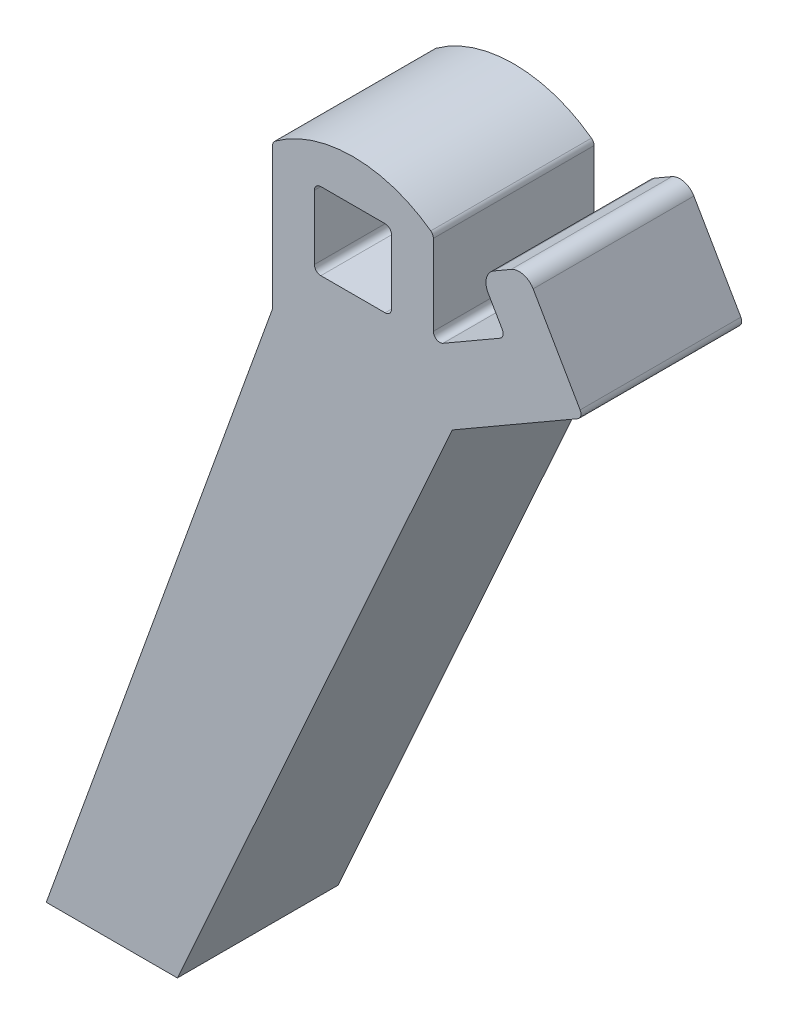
ISO-10303-21;
HEADER;
FILE_DESCRIPTION(('STEP AP214'),'2;1');
FILE_NAME('part.step','',(''),(''),'','','');
FILE_SCHEMA(('AUTOMOTIVE_DESIGN { 1 0 10303 214 1 1 1 1 }'));
ENDSEC;
DATA;
#1=APPLICATION_CONTEXT('core data for automotive mechanical design processes');
#2=APPLICATION_PROTOCOL_DEFINITION('international standard','automotive_design',2000,#1);
#3=PRODUCT_CONTEXT('',#1,'mechanical');
#4=PRODUCT('Part','Part','',(#3));
#5=PRODUCT_RELATED_PRODUCT_CATEGORY('part','',(#4));
#6=PRODUCT_DEFINITION_FORMATION('','',#4);
#7=PRODUCT_DEFINITION_CONTEXT('part definition',#1,'design');
#8=PRODUCT_DEFINITION('design','',#6,#7);
#9=PRODUCT_DEFINITION_SHAPE('','',#8);
#10=(LENGTH_UNIT() NAMED_UNIT(*) SI_UNIT(.MILLI.,.METRE.));
#11=(NAMED_UNIT(*) PLANE_ANGLE_UNIT() SI_UNIT($,.RADIAN.));
#12=(NAMED_UNIT(*) SI_UNIT($,.STERADIAN.) SOLID_ANGLE_UNIT());
#13=UNCERTAINTY_MEASURE_WITH_UNIT(LENGTH_MEASURE(1.E-05),#10,'distance_accuracy_value','');
#14=(GEOMETRIC_REPRESENTATION_CONTEXT(3) GLOBAL_UNCERTAINTY_ASSIGNED_CONTEXT((#13)) GLOBAL_UNIT_ASSIGNED_CONTEXT((#10,
#11,#12)) REPRESENTATION_CONTEXT('',''));
#15=CARTESIAN_POINT('',(0.,0.,0.));
#16=DIRECTION('',(0.,0.,1.));
#17=DIRECTION('',(1.,0.,0.));
#18=AXIS2_PLACEMENT_3D('',#15,#16,#17);
#19=CARTESIAN_POINT('',(12.1164041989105,26.3831358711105,6.35));
#20=DIRECTION('',(0.,0.,1.));
#21=DIRECTION('',(1.,0.,0.));
#22=AXIS2_PLACEMENT_3D('',#19,#20,#21);
#23=PLANE('',#22);
#24=DIRECTION('',(-0.5,0.866025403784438,0.));
#25=VECTOR('',#24,1.);
#26=CARTESIAN_POINT('',(21.2166310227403,27.1696600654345,6.35));
#27=LINE('',#26,#25);
#28=CARTESIAN_POINT('',(21.0896310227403,27.3896305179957,6.35));
#29=VERTEX_POINT('',#28);
#30=CARTESIAN_POINT('',(19.2338141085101,30.603999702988,6.35));
#31=VERTEX_POINT('',#30);
#32=EDGE_CURVE('E372',#29,#31,#27,.T.);
#33=ORIENTED_EDGE('',*,*,#32,.T.);
#34=CARTESIAN_POINT('',(18.683887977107,30.286499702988,6.35));
#35=DIRECTION('',(0.,0.,1.));
#36=DIRECTION('',(1.,0.,0.));
#37=AXIS2_PLACEMENT_3D('',#34,#35,#36);
#38=CIRCLE('',#37,0.635);
#39=CARTESIAN_POINT('',(18.366387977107,30.8364258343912,6.35));
#40=VERTEX_POINT('',#39);
#41=EDGE_CURVE('E298',#31,#40,#38,.T.);
#42=ORIENTED_EDGE('',*,*,#41,.T.);
#43=DIRECTION('',(-0.866025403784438,-0.500000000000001,0.));
#44=VECTOR('',#43,1.);
#45=CARTESIAN_POINT('',(18.9163141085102,31.1539258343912,6.35));
#46=LINE('',#45,#44);
#47=CARTESIAN_POINT('',(17.6858741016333,30.4435309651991,6.35));
#48=VERTEX_POINT('',#47);
#49=EDGE_CURVE('E374',#40,#48,#46,.T.);
#50=ORIENTED_EDGE('',*,*,#49,.T.);
#51=CARTESIAN_POINT('',(18.0033741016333,29.893604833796,6.35));
#52=DIRECTION('',(0.,0.,1.));
#53=DIRECTION('',(1.,0.,0.));
#54=AXIS2_PLACEMENT_3D('',#51,#52,#53);
#55=CIRCLE('',#54,0.635);
#56=CARTESIAN_POINT('',(17.4534479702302,29.576104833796,6.35));
#57=VERTEX_POINT('',#56);
#58=EDGE_CURVE('E296',#48,#57,#55,.T.);
#59=ORIENTED_EDGE('',*,*,#58,.T.);
#60=DIRECTION('',(0.500000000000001,-0.866025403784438,0.));
#61=VECTOR('',#60,1.);
#62=CARTESIAN_POINT('',(17.1359479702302,30.1260309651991,6.35));
#63=LINE('',#62,#61);
#64=CARTESIAN_POINT('',(18.0136404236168,28.6058230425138,6.35));
#65=VERTEX_POINT('',#64);
#66=EDGE_CURVE('E377',#57,#65,#63,.T.);
#67=ORIENTED_EDGE('',*,*,#66,.T.);
#68=CARTESIAN_POINT('',(17.7936699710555,28.4788230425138,6.35));
#69=DIRECTION('',(0.,0.,1.));
#70=DIRECTION('',(1.,0.,0.));
#71=AXIS2_PLACEMENT_3D('',#68,#69,#70);
#72=CIRCLE('',#71,0.254);
#73=CARTESIAN_POINT('',(17.9206699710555,28.2588525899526,6.35));
#74=VERTEX_POINT('',#73);
#75=EDGE_CURVE('E283',#65,#74,#72,.F.);
#76=ORIENTED_EDGE('',*,*,#75,.T.);
#77=DIRECTION('',(-0.866025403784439,-0.5,0.));
#78=VECTOR('',#77,1.);
#79=CARTESIAN_POINT('',(15.2914041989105,26.7408452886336,6.35));
#80=LINE('',#79,#78);
#81=CARTESIAN_POINT('',(15.6724041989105,26.9608157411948,6.35));
#82=VERTEX_POINT('',#81);
#83=EDGE_CURVE('E379',#74,#82,#80,.T.);
#84=ORIENTED_EDGE('',*,*,#83,.T.);
#85=CARTESIAN_POINT('',(15.5454041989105,27.1807861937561,6.35));
#86=DIRECTION('',(0.,0.,1.));
#87=DIRECTION('',(1.,0.,0.));
#88=AXIS2_PLACEMENT_3D('',#85,#86,#87);
#89=CIRCLE('',#88,0.254);
#90=CARTESIAN_POINT('',(15.2914041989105,27.1807861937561,6.35));
#91=VERTEX_POINT('',#90);
#92=EDGE_CURVE('E278',#82,#91,#89,.F.);
#93=ORIENTED_EDGE('',*,*,#92,.T.);
#94=DIRECTION('',(0.,1.,0.));
#95=VECTOR('',#94,1.);
#96=CARTESIAN_POINT('',(15.2914041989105,26.7408452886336,6.35));
#97=LINE('',#96,#95);
#98=CARTESIAN_POINT('',(15.2914041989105,30.3599271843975,6.35));
#99=VERTEX_POINT('',#98);
#100=EDGE_CURVE('E382',#91,#99,#97,.T.);
#101=ORIENTED_EDGE('',*,*,#100,.T.);
#102=CARTESIAN_POINT('',(15.0374041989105,30.3599271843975,6.35));
#103=DIRECTION('',(0.,0.,1.));
#104=DIRECTION('',(1.,0.,0.));
#105=AXIS2_PLACEMENT_3D('',#102,#103,#104);
#106=CIRCLE('',#105,0.254);
#107=CARTESIAN_POINT('',(15.187767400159,30.5646389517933,6.35));
#108=VERTEX_POINT('',#107);
#109=EDGE_CURVE('E251',#99,#108,#106,.T.);
#110=ORIENTED_EDGE('',*,*,#109,.T.);
#111=CARTESIAN_POINT('',(12.1164041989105,26.3831358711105,6.35));
#112=DIRECTION('',(0.,0.,1.));
#113=DIRECTION('',(1.,0.,0.));
#114=AXIS2_PLACEMENT_3D('',#111,#112,#113);
#115=CIRCLE('',#114,5.18827909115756);
#116=CARTESIAN_POINT('',(9.04504099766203,30.5646389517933,6.35));
#117=VERTEX_POINT('',#116);
#118=EDGE_CURVE('E384',#108,#117,#115,.T.);
#119=ORIENTED_EDGE('',*,*,#118,.T.);
#120=CARTESIAN_POINT('',(9.19540419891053,30.3599271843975,6.35));
#121=DIRECTION('',(0.,0.,1.));
#122=DIRECTION('',(1.,0.,0.));
#123=AXIS2_PLACEMENT_3D('',#120,#121,#122);
#124=CIRCLE('',#123,0.254);
#125=CARTESIAN_POINT('',(8.94140419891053,30.3599271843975,6.35));
#126=VERTEX_POINT('',#125);
#127=EDGE_CURVE('E249',#117,#126,#124,.T.);
#128=ORIENTED_EDGE('',*,*,#127,.T.);
#129=DIRECTION('',(0.,-1.,0.));
#130=VECTOR('',#129,1.);
#131=CARTESIAN_POINT('',(8.94140419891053,24.7827355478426,6.35));
#132=LINE('',#131,#130);
#133=CARTESIAN_POINT('',(8.94140419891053,24.7827355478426,6.35));
#134=VERTEX_POINT('',#133);
#135=EDGE_CURVE('E222',#126,#134,#132,.T.);
#136=ORIENTED_EDGE('',*,*,#135,.T.);
#137=DIRECTION('',(-0.339378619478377,-0.940649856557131,0.));
#138=VECTOR('',#137,1.);
#139=CARTESIAN_POINT('',(0.,0.,6.35));
#140=LINE('',#139,#138);
#141=CARTESIAN_POINT('',(0.,0.,6.35));
#142=VERTEX_POINT('',#141);
#143=EDGE_CURVE('E217',#134,#142,#140,.T.);
#144=ORIENTED_EDGE('',*,*,#143,.T.);
#145=DIRECTION('',(1.,0.,0.));
#146=VECTOR('',#145,1.);
#147=CARTESIAN_POINT('',(0.,0.,6.35));
#148=LINE('',#147,#146);
#149=CARTESIAN_POINT('',(5.179316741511,0.,6.35));
#150=VERTEX_POINT('',#149);
#151=EDGE_CURVE('E206',#142,#150,#148,.T.);
#152=ORIENTED_EDGE('',*,*,#151,.T.);
#153=DIRECTION('',(0.409706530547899,0.912217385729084,0.));
#154=VECTOR('',#153,1.);
#155=CARTESIAN_POINT('',(5.179316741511,0.,6.35));
#156=LINE('',#155,#154);
#157=CARTESIAN_POINT('',(16.0396761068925,24.1807437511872,6.35));
#158=VERTEX_POINT('',#157);
#159=EDGE_CURVE('E216',#150,#158,#156,.T.);
#160=ORIENTED_EDGE('',*,*,#159,.T.);
#161=DIRECTION('',(0.866025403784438,0.5,0.));
#162=VECTOR('',#161,1.);
#163=CARTESIAN_POINT('',(16.0396761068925,24.1807437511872,6.35));
#164=LINE('',#163,#162);
#165=CARTESIAN_POINT('',(20.996660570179,27.0426600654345,6.35));
#166=VERTEX_POINT('',#165);
#167=EDGE_CURVE('E369',#158,#166,#164,.T.);
#168=ORIENTED_EDGE('',*,*,#167,.T.);
#169=CARTESIAN_POINT('',(20.8696605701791,27.2626305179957,6.35));
#170=DIRECTION('',(0.,0.,1.));
#171=DIRECTION('',(1.,0.,0.));
#172=AXIS2_PLACEMENT_3D('',#169,#170,#171);
#173=CIRCLE('',#172,0.254);
#174=EDGE_CURVE('E271',#166,#29,#173,.T.);
#175=ORIENTED_EDGE('',*,*,#174,.T.);
#176=EDGE_LOOP('',(#33,#42,#50,#59,#67,#76,#84,#93,#101,#110,#119,#128,#136,#144,#152,#160,#168,#175));
#177=FACE_BOUND('',#176,.T.);
#178=DIRECTION('',(-1.,0.,0.));
#179=VECTOR('',#178,1.);
#180=CARTESIAN_POINT('',(10.5924041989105,29.9098525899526,6.35));
#181=LINE('',#180,#179);
#182=CARTESIAN_POINT('',(13.3864041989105,29.9098525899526,6.35));
#183=VERTEX_POINT('',#182);
#184=CARTESIAN_POINT('',(10.8464041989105,29.9098525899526,6.35));
#185=VERTEX_POINT('',#184);
#186=EDGE_CURVE('E351',#183,#185,#181,.T.);
#187=ORIENTED_EDGE('',*,*,#186,.F.);
#188=CARTESIAN_POINT('',(13.3864041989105,29.6558525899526,6.35));
#189=DIRECTION('',(0.,0.,1.));
#190=DIRECTION('',(1.,0.,0.));
#191=AXIS2_PLACEMENT_3D('',#188,#189,#190);
#192=CIRCLE('',#191,0.254);
#193=CARTESIAN_POINT('',(13.6404041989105,29.6558525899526,6.35));
#194=VERTEX_POINT('',#193);
#195=EDGE_CURVE('E332',#183,#194,#192,.F.);
#196=ORIENTED_EDGE('',*,*,#195,.T.);
#197=DIRECTION('',(0.,1.,0.));
#198=VECTOR('',#197,1.);
#199=CARTESIAN_POINT('',(13.6404041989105,29.9098525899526,6.35));
#200=LINE('',#199,#198);
#201=CARTESIAN_POINT('',(13.6404041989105,27.1158525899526,6.35));
#202=VERTEX_POINT('',#201);
#203=EDGE_CURVE('E354',#202,#194,#200,.T.);
#204=ORIENTED_EDGE('',*,*,#203,.F.);
#205=CARTESIAN_POINT('',(13.3864041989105,27.1158525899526,6.35));
#206=DIRECTION('',(0.,0.,1.));
#207=DIRECTION('',(1.,0.,0.));
#208=AXIS2_PLACEMENT_3D('',#205,#206,#207);
#209=CIRCLE('',#208,0.254);
#210=CARTESIAN_POINT('',(13.3864041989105,26.8618525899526,6.35));
#211=VERTEX_POINT('',#210);
#212=EDGE_CURVE('E324',#202,#211,#209,.F.);
#213=ORIENTED_EDGE('',*,*,#212,.T.);
#214=DIRECTION('',(1.,0.,0.));
#215=VECTOR('',#214,1.);
#216=CARTESIAN_POINT('',(10.5924041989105,26.8618525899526,6.35));
#217=LINE('',#216,#215);
#218=CARTESIAN_POINT('',(10.8464041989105,26.8618525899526,6.35));
#219=VERTEX_POINT('',#218);
#220=EDGE_CURVE('E356',#219,#211,#217,.T.);
#221=ORIENTED_EDGE('',*,*,#220,.F.);
#222=CARTESIAN_POINT('',(10.8464041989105,27.1158525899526,6.35));
#223=DIRECTION('',(0.,0.,1.));
#224=DIRECTION('',(1.,0.,0.));
#225=AXIS2_PLACEMENT_3D('',#222,#223,#224);
#226=CIRCLE('',#225,0.254);
#227=CARTESIAN_POINT('',(10.5924041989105,27.1158525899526,6.35));
#228=VERTEX_POINT('',#227);
#229=EDGE_CURVE('E328',#219,#228,#226,.F.);
#230=ORIENTED_EDGE('',*,*,#229,.T.);
#231=DIRECTION('',(0.,-1.,0.));
#232=VECTOR('',#231,1.);
#233=CARTESIAN_POINT('',(10.5924041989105,29.9098525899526,6.35));
#234=LINE('',#233,#232);
#235=CARTESIAN_POINT('',(10.5924041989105,29.6558525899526,6.35));
#236=VERTEX_POINT('',#235);
#237=EDGE_CURVE('E353',#236,#228,#234,.T.);
#238=ORIENTED_EDGE('',*,*,#237,.F.);
#239=CARTESIAN_POINT('',(10.8464041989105,29.6558525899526,6.35));
#240=DIRECTION('',(0.,0.,1.));
#241=DIRECTION('',(1.,0.,0.));
#242=AXIS2_PLACEMENT_3D('',#239,#240,#241);
#243=CIRCLE('',#242,0.254);
#244=EDGE_CURVE('E11',#236,#185,#243,.F.);
#245=ORIENTED_EDGE('',*,*,#244,.T.);
#246=EDGE_LOOP('',(#187,#196,#204,#213,#221,#230,#238,#245));
#247=FACE_BOUND('',#246,.T.);
#248=ADVANCED_FACE('F33',(#177,#247),#23,.T.);
#249=CARTESIAN_POINT('',(12.1164041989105,26.3831358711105,0.));
#250=DIRECTION('',(0.,0.,1.));
#251=DIRECTION('',(1.,0.,0.));
#252=AXIS2_PLACEMENT_3D('',#249,#250,#251);
#253=PLANE('',#252);
#254=DIRECTION('',(-0.866025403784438,-0.500000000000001,0.));
#255=VECTOR('',#254,1.);
#256=CARTESIAN_POINT('',(18.9163141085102,31.1539258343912,0.));
#257=LINE('',#256,#255);
#258=CARTESIAN_POINT('',(18.366387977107,30.8364258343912,0.));
#259=VERTEX_POINT('',#258);
#260=CARTESIAN_POINT('',(17.6858741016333,30.4435309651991,0.));
#261=VERTEX_POINT('',#260);
#262=EDGE_CURVE('E400',#259,#261,#257,.T.);
#263=ORIENTED_EDGE('',*,*,#262,.F.);
#264=CARTESIAN_POINT('',(18.683887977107,30.286499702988,0.));
#265=DIRECTION('',(0.,0.,1.));
#266=DIRECTION('',(1.,0.,0.));
#267=AXIS2_PLACEMENT_3D('',#264,#265,#266);
#268=CIRCLE('',#267,0.635);
#269=CARTESIAN_POINT('',(19.2338141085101,30.603999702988,0.));
#270=VERTEX_POINT('',#269);
#271=EDGE_CURVE('E292',#259,#270,#268,.F.);
#272=ORIENTED_EDGE('',*,*,#271,.T.);
#273=DIRECTION('',(-0.5,0.866025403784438,0.));
#274=VECTOR('',#273,1.);
#275=CARTESIAN_POINT('',(21.2166310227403,27.1696600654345,0.));
#276=LINE('',#275,#274);
#277=CARTESIAN_POINT('',(21.0896310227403,27.3896305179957,0.));
#278=VERTEX_POINT('',#277);
#279=EDGE_CURVE('E397',#278,#270,#276,.T.);
#280=ORIENTED_EDGE('',*,*,#279,.F.);
#281=CARTESIAN_POINT('',(20.8696605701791,27.2626305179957,0.));
#282=DIRECTION('',(0.,0.,1.));
#283=DIRECTION('',(1.,0.,0.));
#284=AXIS2_PLACEMENT_3D('',#281,#282,#283);
#285=CIRCLE('',#284,0.254);
#286=CARTESIAN_POINT('',(20.996660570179,27.0426600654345,0.));
#287=VERTEX_POINT('',#286);
#288=EDGE_CURVE('E267',#278,#287,#285,.F.);
#289=ORIENTED_EDGE('',*,*,#288,.T.);
#290=DIRECTION('',(0.866025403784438,0.5,0.));
#291=VECTOR('',#290,1.);
#292=CARTESIAN_POINT('',(16.0396761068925,24.1807437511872,0.));
#293=LINE('',#292,#291);
#294=CARTESIAN_POINT('',(16.0396761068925,24.1807437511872,0.));
#295=VERTEX_POINT('',#294);
#296=EDGE_CURVE('E394',#295,#287,#293,.T.);
#297=ORIENTED_EDGE('',*,*,#296,.F.);
#298=DIRECTION('',(0.409706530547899,0.912217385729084,0.));
#299=VECTOR('',#298,1.);
#300=CARTESIAN_POINT('',(5.179316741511,0.,0.));
#301=LINE('',#300,#299);
#302=CARTESIAN_POINT('',(5.179316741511,0.,0.));
#303=VERTEX_POINT('',#302);
#304=EDGE_CURVE('E392',#303,#295,#301,.T.);
#305=ORIENTED_EDGE('',*,*,#304,.F.);
#306=DIRECTION('',(1.,0.,0.));
#307=VECTOR('',#306,1.);
#308=CARTESIAN_POINT('',(0.,0.,0.));
#309=LINE('',#308,#307);
#310=CARTESIAN_POINT('',(0.,0.,0.));
#311=VERTEX_POINT('',#310);
#312=EDGE_CURVE('E390',#311,#303,#309,.T.);
#313=ORIENTED_EDGE('',*,*,#312,.F.);
#314=DIRECTION('',(-0.339378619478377,-0.940649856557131,0.));
#315=VECTOR('',#314,1.);
#316=CARTESIAN_POINT('',(0.,0.,0.));
#317=LINE('',#316,#315);
#318=CARTESIAN_POINT('',(8.94140419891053,24.7827355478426,0.));
#319=VERTEX_POINT('',#318);
#320=EDGE_CURVE('E230',#319,#311,#317,.T.);
#321=ORIENTED_EDGE('',*,*,#320,.F.);
#322=DIRECTION('',(0.,-1.,0.));
#323=VECTOR('',#322,1.);
#324=CARTESIAN_POINT('',(8.94140419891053,24.7827355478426,0.));
#325=LINE('',#324,#323);
#326=CARTESIAN_POINT('',(8.94140419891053,30.3599271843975,0.));
#327=VERTEX_POINT('',#326);
#328=EDGE_CURVE('E226',#327,#319,#325,.T.);
#329=ORIENTED_EDGE('',*,*,#328,.F.);
#330=CARTESIAN_POINT('',(9.19540419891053,30.3599271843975,0.));
#331=DIRECTION('',(0.,0.,1.));
#332=DIRECTION('',(1.,0.,0.));
#333=AXIS2_PLACEMENT_3D('',#330,#331,#332);
#334=CIRCLE('',#333,0.254);
#335=CARTESIAN_POINT('',(9.04504099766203,30.5646389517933,0.));
#336=VERTEX_POINT('',#335);
#337=EDGE_CURVE('E241',#327,#336,#334,.F.);
#338=ORIENTED_EDGE('',*,*,#337,.T.);
#339=CARTESIAN_POINT('',(12.1164041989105,26.3831358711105,0.));
#340=DIRECTION('',(0.,0.,1.));
#341=DIRECTION('',(1.,0.,0.));
#342=AXIS2_PLACEMENT_3D('',#339,#340,#341);
#343=CIRCLE('',#342,5.18827909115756);
#344=CARTESIAN_POINT('',(15.187767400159,30.5646389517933,0.));
#345=VERTEX_POINT('',#344);
#346=EDGE_CURVE('E410',#345,#336,#343,.T.);
#347=ORIENTED_EDGE('',*,*,#346,.F.);
#348=CARTESIAN_POINT('',(15.0374041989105,30.3599271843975,0.));
#349=DIRECTION('',(0.,0.,1.));
#350=DIRECTION('',(1.,0.,0.));
#351=AXIS2_PLACEMENT_3D('',#348,#349,#350);
#352=CIRCLE('',#351,0.254);
#353=CARTESIAN_POINT('',(15.2914041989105,30.3599271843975,0.));
#354=VERTEX_POINT('',#353);
#355=EDGE_CURVE('E243',#345,#354,#352,.F.);
#356=ORIENTED_EDGE('',*,*,#355,.T.);
#357=DIRECTION('',(0.,1.,0.));
#358=VECTOR('',#357,1.);
#359=CARTESIAN_POINT('',(15.2914041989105,26.7408452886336,0.));
#360=LINE('',#359,#358);
#361=CARTESIAN_POINT('',(15.2914041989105,27.1807861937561,0.));
#362=VERTEX_POINT('',#361);
#363=EDGE_CURVE('E408',#362,#354,#360,.T.);
#364=ORIENTED_EDGE('',*,*,#363,.F.);
#365=CARTESIAN_POINT('',(15.5454041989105,27.1807861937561,0.));
#366=DIRECTION('',(0.,0.,1.));
#367=DIRECTION('',(1.,0.,0.));
#368=AXIS2_PLACEMENT_3D('',#365,#366,#367);
#369=CIRCLE('',#368,0.254);
#370=CARTESIAN_POINT('',(15.6724041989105,26.9608157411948,0.));
#371=VERTEX_POINT('',#370);
#372=EDGE_CURVE('E276',#362,#371,#369,.T.);
#373=ORIENTED_EDGE('',*,*,#372,.T.);
#374=DIRECTION('',(-0.866025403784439,-0.5,0.));
#375=VECTOR('',#374,1.);
#376=CARTESIAN_POINT('',(15.2914041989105,26.7408452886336,0.));
#377=LINE('',#376,#375);
#378=CARTESIAN_POINT('',(17.9206699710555,28.2588525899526,0.));
#379=VERTEX_POINT('',#378);
#380=EDGE_CURVE('E405',#379,#371,#377,.T.);
#381=ORIENTED_EDGE('',*,*,#380,.F.);
#382=CARTESIAN_POINT('',(17.7936699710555,28.4788230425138,0.));
#383=DIRECTION('',(0.,0.,1.));
#384=DIRECTION('',(1.,0.,0.));
#385=AXIS2_PLACEMENT_3D('',#382,#383,#384);
#386=CIRCLE('',#385,0.254);
#387=CARTESIAN_POINT('',(18.0136404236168,28.6058230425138,0.));
#388=VERTEX_POINT('',#387);
#389=EDGE_CURVE('E280',#379,#388,#386,.T.);
#390=ORIENTED_EDGE('',*,*,#389,.T.);
#391=DIRECTION('',(0.500000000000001,-0.866025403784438,0.));
#392=VECTOR('',#391,1.);
#393=CARTESIAN_POINT('',(17.1359479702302,30.1260309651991,0.));
#394=LINE('',#393,#392);
#395=CARTESIAN_POINT('',(17.4534479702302,29.576104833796,0.));
#396=VERTEX_POINT('',#395);
#397=EDGE_CURVE('E403',#396,#388,#394,.T.);
#398=ORIENTED_EDGE('',*,*,#397,.F.);
#399=CARTESIAN_POINT('',(18.0033741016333,29.893604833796,0.));
#400=DIRECTION('',(0.,0.,1.));
#401=DIRECTION('',(1.,0.,0.));
#402=AXIS2_PLACEMENT_3D('',#399,#400,#401);
#403=CIRCLE('',#402,0.635);
#404=EDGE_CURVE('E290',#396,#261,#403,.F.);
#405=ORIENTED_EDGE('',*,*,#404,.T.);
#406=EDGE_LOOP('',(#263,#272,#280,#289,#297,#305,#313,#321,#329,#338,#347,#356,#364,#373,#381,
#390,#398,#405));
#407=FACE_BOUND('',#406,.T.);
#408=DIRECTION('',(1.,0.,0.));
#409=VECTOR('',#408,1.);
#410=CARTESIAN_POINT('',(10.5924041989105,26.8618525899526,0.));
#411=LINE('',#410,#409);
#412=CARTESIAN_POINT('',(10.8464041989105,26.8618525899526,0.));
#413=VERTEX_POINT('',#412);
#414=CARTESIAN_POINT('',(13.3864041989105,26.8618525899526,0.));
#415=VERTEX_POINT('',#414);
#416=EDGE_CURVE('E348',#413,#415,#411,.T.);
#417=ORIENTED_EDGE('',*,*,#416,.T.);
#418=CARTESIAN_POINT('',(13.3864041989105,27.1158525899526,0.));
#419=DIRECTION('',(0.,0.,1.));
#420=DIRECTION('',(1.,0.,0.));
#421=AXIS2_PLACEMENT_3D('',#418,#419,#420);
#422=CIRCLE('',#421,0.254);
#423=CARTESIAN_POINT('',(13.6404041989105,27.1158525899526,0.));
#424=VERTEX_POINT('',#423);
#425=EDGE_CURVE('E322',#415,#424,#422,.T.);
#426=ORIENTED_EDGE('',*,*,#425,.T.);
#427=DIRECTION('',(0.,1.,0.));
#428=VECTOR('',#427,1.);
#429=CARTESIAN_POINT('',(13.6404041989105,29.9098525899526,0.));
#430=LINE('',#429,#428);
#431=CARTESIAN_POINT('',(13.6404041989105,29.6558525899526,0.));
#432=VERTEX_POINT('',#431);
#433=EDGE_CURVE('E363',#424,#432,#430,.T.);
#434=ORIENTED_EDGE('',*,*,#433,.T.);
#435=CARTESIAN_POINT('',(13.3864041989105,29.6558525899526,0.));
#436=DIRECTION('',(0.,0.,1.));
#437=DIRECTION('',(1.,0.,0.));
#438=AXIS2_PLACEMENT_3D('',#435,#436,#437);
#439=CIRCLE('',#438,0.254);
#440=CARTESIAN_POINT('',(13.3864041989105,29.9098525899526,0.));
#441=VERTEX_POINT('',#440);
#442=EDGE_CURVE('E330',#432,#441,#439,.T.);
#443=ORIENTED_EDGE('',*,*,#442,.T.);
#444=DIRECTION('',(-1.,0.,0.));
#445=VECTOR('',#444,1.);
#446=CARTESIAN_POINT('',(10.5924041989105,29.9098525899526,0.));
#447=LINE('',#446,#445);
#448=CARTESIAN_POINT('',(10.8464041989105,29.9098525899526,0.));
#449=VERTEX_POINT('',#448);
#450=EDGE_CURVE('E340',#441,#449,#447,.T.);
#451=ORIENTED_EDGE('',*,*,#450,.T.);
#452=CARTESIAN_POINT('',(10.8464041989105,29.6558525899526,0.));
#453=DIRECTION('',(0.,0.,1.));
#454=DIRECTION('',(1.,0.,0.));
#455=AXIS2_PLACEMENT_3D('',#452,#453,#454);
#456=CIRCLE('',#455,0.254);
#457=CARTESIAN_POINT('',(10.5924041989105,29.6558525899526,0.));
#458=VERTEX_POINT('',#457);
#459=EDGE_CURVE('E41',#449,#458,#456,.T.);
#460=ORIENTED_EDGE('',*,*,#459,.T.);
#461=DIRECTION('',(0.,-1.,0.));
#462=VECTOR('',#461,1.);
#463=CARTESIAN_POINT('',(10.5924041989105,29.9098525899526,0.));
#464=LINE('',#463,#462);
#465=CARTESIAN_POINT('',(10.5924041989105,27.1158525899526,0.));
#466=VERTEX_POINT('',#465);
#467=EDGE_CURVE('E339',#458,#466,#464,.T.);
#468=ORIENTED_EDGE('',*,*,#467,.T.);
#469=CARTESIAN_POINT('',(10.8464041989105,27.1158525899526,0.));
#470=DIRECTION('',(0.,0.,1.));
#471=DIRECTION('',(1.,0.,0.));
#472=AXIS2_PLACEMENT_3D('',#469,#470,#471);
#473=CIRCLE('',#472,0.254);
#474=EDGE_CURVE('E326',#466,#413,#473,.T.);
#475=ORIENTED_EDGE('',*,*,#474,.T.);
#476=EDGE_LOOP('',(#417,#426,#434,#443,#451,#460,#468,#475));
#477=FACE_BOUND('',#476,.T.);
#478=ADVANCED_FACE('F338',(#407,#477),#253,.F.);
#479=CARTESIAN_POINT('',(0.,0.,6.35));
#480=DIRECTION('',(0.940649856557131,-0.339378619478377,0.));
#481=DIRECTION('',(0.339378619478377,0.940649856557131,0.));
#482=AXIS2_PLACEMENT_3D('',#479,#480,#481);
#483=PLANE('',#482);
#484=ORIENTED_EDGE('',*,*,#320,.T.);
#485=DIRECTION('',(0.,0.,-1.));
#486=VECTOR('',#485,1.);
#487=CARTESIAN_POINT('',(0.,0.,6.35));
#488=LINE('',#487,#486);
#489=EDGE_CURVE('E210',#142,#311,#488,.T.);
#490=ORIENTED_EDGE('',*,*,#489,.F.);
#491=ORIENTED_EDGE('',*,*,#143,.F.);
#492=DIRECTION('',(0.,0.,-1.));
#493=VECTOR('',#492,1.);
#494=CARTESIAN_POINT('',(8.94140419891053,24.7827355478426,6.35));
#495=LINE('',#494,#493);
#496=EDGE_CURVE('E388',#134,#319,#495,.T.);
#497=ORIENTED_EDGE('',*,*,#496,.T.);
#498=EDGE_LOOP('',(#484,#490,#491,#497));
#499=FACE_BOUND('',#498,.T.);
#500=ADVANCED_FACE('F228',(#499),#483,.F.);
#501=CARTESIAN_POINT('',(0.,0.,6.35));
#502=DIRECTION('',(0.,1.,0.));
#503=DIRECTION('',(0.,0.,1.));
#504=AXIS2_PLACEMENT_3D('',#501,#502,#503);
#505=PLANE('',#504);
#506=ORIENTED_EDGE('',*,*,#312,.T.);
#507=DIRECTION('',(0.,0.,-1.));
#508=VECTOR('',#507,1.);
#509=CARTESIAN_POINT('',(5.179316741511,0.,6.35));
#510=LINE('',#509,#508);
#511=EDGE_CURVE('E213',#150,#303,#510,.T.);
#512=ORIENTED_EDGE('',*,*,#511,.F.);
#513=ORIENTED_EDGE('',*,*,#151,.F.);
#514=ORIENTED_EDGE('',*,*,#489,.T.);
#515=EDGE_LOOP('',(#506,#512,#513,#514));
#516=FACE_BOUND('',#515,.T.);
#517=ADVANCED_FACE('F208',(#516),#505,.F.);
#518=CARTESIAN_POINT('',(5.179316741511,0.,6.35));
#519=DIRECTION('',(-0.912217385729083,0.409706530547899,0.));
#520=DIRECTION('',(-0.409706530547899,-0.912217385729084,0.));
#521=AXIS2_PLACEMENT_3D('',#518,#519,#520);
#522=PLANE('',#521);
#523=ORIENTED_EDGE('',*,*,#304,.T.);
#524=DIRECTION('',(0.,0.,-1.));
#525=VECTOR('',#524,1.);
#526=CARTESIAN_POINT('',(16.0396761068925,24.1807437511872,6.35));
#527=LINE('',#526,#525);
#528=EDGE_CURVE('E235',#158,#295,#527,.T.);
#529=ORIENTED_EDGE('',*,*,#528,.F.);
#530=ORIENTED_EDGE('',*,*,#159,.F.);
#531=ORIENTED_EDGE('',*,*,#511,.T.);
#532=EDGE_LOOP('',(#523,#529,#530,#531));
#533=FACE_BOUND('',#532,.T.);
#534=ADVANCED_FACE('F485',(#533),#522,.F.);
#535=CARTESIAN_POINT('',(16.0396761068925,24.1807437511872,6.35));
#536=DIRECTION('',(-0.5,0.866025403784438,0.));
#537=DIRECTION('',(-0.866025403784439,-0.5,0.));
#538=AXIS2_PLACEMENT_3D('',#535,#536,#537);
#539=PLANE('',#538);
#540=ORIENTED_EDGE('',*,*,#296,.T.);
#541=DIRECTION('',(0.,0.,-1.));
#542=VECTOR('',#541,1.);
#543=CARTESIAN_POINT('',(20.9966605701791,27.0426600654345,6.35));
#544=LINE('',#543,#542);
#545=EDGE_CURVE('E269',#287,#166,#544,.F.);
#546=ORIENTED_EDGE('',*,*,#545,.T.);
#547=ORIENTED_EDGE('',*,*,#167,.F.);
#548=ORIENTED_EDGE('',*,*,#528,.T.);
#549=EDGE_LOOP('',(#540,#546,#547,#548));
#550=FACE_BOUND('',#549,.T.);
#551=ADVANCED_FACE('F419',(#550),#539,.F.);
#552=CARTESIAN_POINT('',(21.2166310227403,27.1696600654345,6.35));
#553=DIRECTION('',(-0.866025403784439,-0.5,0.));
#554=DIRECTION('',(0.5,-0.866025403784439,0.));
#555=AXIS2_PLACEMENT_3D('',#552,#553,#554);
#556=PLANE('',#555);
#557=ORIENTED_EDGE('',*,*,#279,.T.);
#558=DIRECTION('',(0.,0.,-1.));
#559=VECTOR('',#558,1.);
#560=CARTESIAN_POINT('',(19.2338141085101,30.603999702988,6.35));
#561=LINE('',#560,#559);
#562=EDGE_CURVE('E294',#270,#31,#561,.F.);
#563=ORIENTED_EDGE('',*,*,#562,.T.);
#564=ORIENTED_EDGE('',*,*,#32,.F.);
#565=DIRECTION('',(0.,0.,-1.));
#566=VECTOR('',#565,1.);
#567=CARTESIAN_POINT('',(21.0896310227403,27.3896305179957,6.35));
#568=LINE('',#567,#566);
#569=EDGE_CURVE('E264',#29,#278,#568,.T.);
#570=ORIENTED_EDGE('',*,*,#569,.T.);
#571=EDGE_LOOP('',(#557,#563,#564,#570));
#572=FACE_BOUND('',#571,.T.);
#573=ADVANCED_FACE('F432',(#572),#556,.F.);
#574=CARTESIAN_POINT('',(18.9163141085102,31.1539258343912,6.35));
#575=DIRECTION('',(0.500000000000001,-0.866025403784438,0.));
#576=DIRECTION('',(0.866025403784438,0.500000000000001,0.));
#577=AXIS2_PLACEMENT_3D('',#574,#575,#576);
#578=PLANE('',#577);
#579=ORIENTED_EDGE('',*,*,#49,.F.);
#580=DIRECTION('',(0.,0.,-1.));
#581=VECTOR('',#580,1.);
#582=CARTESIAN_POINT('',(18.366387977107,30.8364258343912,6.35));
#583=LINE('',#582,#581);
#584=EDGE_CURVE('E287',#40,#259,#583,.T.);
#585=ORIENTED_EDGE('',*,*,#584,.T.);
#586=ORIENTED_EDGE('',*,*,#262,.T.);
#587=DIRECTION('',(0.,0.,-1.));
#588=VECTOR('',#587,1.);
#589=CARTESIAN_POINT('',(17.6858741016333,30.4435309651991,6.35));
#590=LINE('',#589,#588);
#591=EDGE_CURVE('E285',#261,#48,#590,.F.);
#592=ORIENTED_EDGE('',*,*,#591,.T.);
#593=EDGE_LOOP('',(#579,#585,#586,#592));
#594=FACE_BOUND('',#593,.T.);
#595=ADVANCED_FACE('F440',(#594),#578,.F.);
#596=CARTESIAN_POINT('',(17.1359479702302,30.1260309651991,6.35));
#597=DIRECTION('',(0.866025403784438,0.500000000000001,0.));
#598=DIRECTION('',(-0.500000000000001,0.866025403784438,0.));
#599=AXIS2_PLACEMENT_3D('',#596,#597,#598);
#600=PLANE('',#599);
#601=ORIENTED_EDGE('',*,*,#66,.F.);
#602=DIRECTION('',(0.,0.,-1.));
#603=VECTOR('',#602,1.);
#604=CARTESIAN_POINT('',(17.4534479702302,29.576104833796,6.35));
#605=LINE('',#604,#603);
#606=EDGE_CURVE('E300',#57,#396,#605,.T.);
#607=ORIENTED_EDGE('',*,*,#606,.T.);
#608=ORIENTED_EDGE('',*,*,#397,.T.);
#609=DIRECTION('',(0.,0.,-1.));
#610=VECTOR('',#609,1.);
#611=CARTESIAN_POINT('',(18.0136404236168,28.6058230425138,6.35));
#612=LINE('',#611,#610);
#613=EDGE_CURVE('E273',#388,#65,#612,.F.);
#614=ORIENTED_EDGE('',*,*,#613,.T.);
#615=EDGE_LOOP('',(#601,#607,#608,#614));
#616=FACE_BOUND('',#615,.T.);
#617=ADVANCED_FACE('F449',(#616),#600,.F.);
#618=CARTESIAN_POINT('',(15.2914041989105,26.7408452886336,6.35));
#619=DIRECTION('',(0.5,-0.866025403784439,0.));
#620=DIRECTION('',(0.866025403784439,0.5,0.));
#621=AXIS2_PLACEMENT_3D('',#618,#619,#620);
#622=PLANE('',#621);
#623=ORIENTED_EDGE('',*,*,#380,.T.);
#624=DIRECTION('',(0.,0.,-1.));
#625=VECTOR('',#624,1.);
#626=CARTESIAN_POINT('',(15.6724041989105,26.9608157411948,6.35));
#627=LINE('',#626,#625);
#628=EDGE_CURVE('E262',#371,#82,#627,.F.);
#629=ORIENTED_EDGE('',*,*,#628,.T.);
#630=ORIENTED_EDGE('',*,*,#83,.F.);
#631=DIRECTION('',(0.,0.,-1.));
#632=VECTOR('',#631,1.);
#633=CARTESIAN_POINT('',(17.9206699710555,28.2588525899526,0.));
#634=LINE('',#633,#632);
#635=EDGE_CURVE('E259',#74,#379,#634,.T.);
#636=ORIENTED_EDGE('',*,*,#635,.T.);
#637=EDGE_LOOP('',(#623,#629,#630,#636));
#638=FACE_BOUND('',#637,.T.);
#639=ADVANCED_FACE('F457',(#638),#622,.F.);
#640=CARTESIAN_POINT('',(15.2914041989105,26.7408452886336,6.35));
#641=DIRECTION('',(-1.,0.,0.));
#642=DIRECTION('',(0.,0.,1.));
#643=AXIS2_PLACEMENT_3D('',#640,#641,#642);
#644=PLANE('',#643);
#645=ORIENTED_EDGE('',*,*,#100,.F.);
#646=DIRECTION('',(0.,0.,-1.));
#647=VECTOR('',#646,1.);
#648=CARTESIAN_POINT('',(15.2914041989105,27.1807861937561,0.));
#649=LINE('',#648,#647);
#650=EDGE_CURVE('E256',#91,#362,#649,.T.);
#651=ORIENTED_EDGE('',*,*,#650,.T.);
#652=ORIENTED_EDGE('',*,*,#363,.T.);
#653=DIRECTION('',(0.,0.,-1.));
#654=VECTOR('',#653,1.);
#655=CARTESIAN_POINT('',(15.2914041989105,30.3599271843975,6.35));
#656=LINE('',#655,#654);
#657=EDGE_CURVE('E246',#354,#99,#656,.F.);
#658=ORIENTED_EDGE('',*,*,#657,.T.);
#659=EDGE_LOOP('',(#645,#651,#652,#658));
#660=FACE_BOUND('',#659,.T.);
#661=ADVANCED_FACE('F467',(#660),#644,.F.);
#662=CARTESIAN_POINT('',(12.1164041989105,26.3831358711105,6.35));
#663=DIRECTION('',(0.,0.,-1.));
#664=DIRECTION('',(-1.,0.,0.));
#665=AXIS2_PLACEMENT_3D('',#662,#663,#664);
#666=CYLINDRICAL_SURFACE('',#665,5.18827909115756);
#667=ORIENTED_EDGE('',*,*,#118,.F.);
#668=DIRECTION('',(0.,0.,-1.));
#669=VECTOR('',#668,1.);
#670=CARTESIAN_POINT('',(15.187767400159,30.5646389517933,6.35));
#671=LINE('',#670,#669);
#672=EDGE_CURVE('E233',#108,#345,#671,.T.);
#673=ORIENTED_EDGE('',*,*,#672,.T.);
#674=ORIENTED_EDGE('',*,*,#346,.T.);
#675=DIRECTION('',(0.,0.,-1.));
#676=VECTOR('',#675,1.);
#677=CARTESIAN_POINT('',(9.04504099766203,30.5646389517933,6.35));
#678=LINE('',#677,#676);
#679=EDGE_CURVE('E231',#336,#117,#678,.F.);
#680=ORIENTED_EDGE('',*,*,#679,.T.);
#681=EDGE_LOOP('',(#667,#673,#674,#680));
#682=FACE_BOUND('',#681,.T.);
#683=ADVANCED_FACE('F476',(#682),#666,.T.);
#684=CARTESIAN_POINT('',(8.94140419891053,24.7827355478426,6.35));
#685=DIRECTION('',(1.,0.,0.));
#686=DIRECTION('',(0.,0.,-1.));
#687=AXIS2_PLACEMENT_3D('',#684,#685,#686);
#688=PLANE('',#687);
#689=ORIENTED_EDGE('',*,*,#135,.F.);
#690=DIRECTION('',(0.,0.,-1.));
#691=VECTOR('',#690,1.);
#692=CARTESIAN_POINT('',(8.94140419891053,30.3599271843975,6.35));
#693=LINE('',#692,#691);
#694=EDGE_CURVE('E253',#126,#327,#693,.T.);
#695=ORIENTED_EDGE('',*,*,#694,.T.);
#696=ORIENTED_EDGE('',*,*,#328,.T.);
#697=ORIENTED_EDGE('',*,*,#496,.F.);
#698=EDGE_LOOP('',(#689,#695,#696,#697));
#699=FACE_BOUND('',#698,.T.);
#700=ADVANCED_FACE('F483',(#699),#688,.F.);
#701=CARTESIAN_POINT('',(13.6404041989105,29.9098525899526,6.35));
#702=DIRECTION('',(-1.,0.,0.));
#703=DIRECTION('',(0.,0.,1.));
#704=AXIS2_PLACEMENT_3D('',#701,#702,#703);
#705=PLANE('',#704);
#706=ORIENTED_EDGE('',*,*,#433,.F.);
#707=DIRECTION('',(0.,0.,-1.));
#708=VECTOR('',#707,1.);
#709=CARTESIAN_POINT('',(13.6404041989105,27.1158525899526,6.35));
#710=LINE('',#709,#708);
#711=EDGE_CURVE('E311',#424,#202,#710,.F.);
#712=ORIENTED_EDGE('',*,*,#711,.T.);
#713=ORIENTED_EDGE('',*,*,#203,.T.);
#714=DIRECTION('',(0.,0.,-1.));
#715=VECTOR('',#714,1.);
#716=CARTESIAN_POINT('',(13.6404041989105,29.6558525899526,0.));
#717=LINE('',#716,#715);
#718=EDGE_CURVE('E308',#194,#432,#717,.T.);
#719=ORIENTED_EDGE('',*,*,#718,.T.);
#720=EDGE_LOOP('',(#706,#712,#713,#719));
#721=FACE_BOUND('',#720,.T.);
#722=ADVANCED_FACE('F501',(#721),#705,.T.);
#723=CARTESIAN_POINT('',(10.5924041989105,29.9098525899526,6.35));
#724=DIRECTION('',(0.,-1.,0.));
#725=DIRECTION('',(0.,0.,-1.));
#726=AXIS2_PLACEMENT_3D('',#723,#724,#725);
#727=PLANE('',#726);
#728=ORIENTED_EDGE('',*,*,#450,.F.);
#729=DIRECTION('',(0.,0.,-1.));
#730=VECTOR('',#729,1.);
#731=CARTESIAN_POINT('',(13.3864041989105,29.9098525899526,6.35));
#732=LINE('',#731,#730);
#733=EDGE_CURVE('E53',#441,#183,#732,.F.);
#734=ORIENTED_EDGE('',*,*,#733,.T.);
#735=ORIENTED_EDGE('',*,*,#186,.T.);
#736=DIRECTION('',(0.,0.,-1.));
#737=VECTOR('',#736,1.);
#738=CARTESIAN_POINT('',(10.8464041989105,29.9098525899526,0.));
#739=LINE('',#738,#737);
#740=EDGE_CURVE('E318',#185,#449,#739,.T.);
#741=ORIENTED_EDGE('',*,*,#740,.T.);
#742=EDGE_LOOP('',(#728,#734,#735,#741));
#743=FACE_BOUND('',#742,.T.);
#744=ADVANCED_FACE('F350',(#743),#727,.T.);
#745=CARTESIAN_POINT('',(10.5924041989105,29.9098525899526,6.35));
#746=DIRECTION('',(1.,0.,0.));
#747=DIRECTION('',(0.,0.,-1.));
#748=AXIS2_PLACEMENT_3D('',#745,#746,#747);
#749=PLANE('',#748);
#750=ORIENTED_EDGE('',*,*,#237,.T.);
#751=DIRECTION('',(0.,0.,-1.));
#752=VECTOR('',#751,1.);
#753=CARTESIAN_POINT('',(10.5924041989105,27.1158525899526,0.));
#754=LINE('',#753,#752);
#755=EDGE_CURVE('E315',#228,#466,#754,.T.);
#756=ORIENTED_EDGE('',*,*,#755,.T.);
#757=ORIENTED_EDGE('',*,*,#467,.F.);
#758=DIRECTION('',(0.,0.,-1.));
#759=VECTOR('',#758,1.);
#760=CARTESIAN_POINT('',(10.5924041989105,29.6558525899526,6.35));
#761=LINE('',#760,#759);
#762=EDGE_CURVE('E313',#458,#236,#761,.F.);
#763=ORIENTED_EDGE('',*,*,#762,.T.);
#764=EDGE_LOOP('',(#750,#756,#757,#763));
#765=FACE_BOUND('',#764,.T.);
#766=ADVANCED_FACE('F346',(#765),#749,.T.);
#767=CARTESIAN_POINT('',(10.5924041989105,26.8618525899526,6.35));
#768=DIRECTION('',(0.,1.,0.));
#769=DIRECTION('',(0.,0.,1.));
#770=AXIS2_PLACEMENT_3D('',#767,#768,#769);
#771=PLANE('',#770);
#772=ORIENTED_EDGE('',*,*,#220,.T.);
#773=DIRECTION('',(0.,0.,-1.));
#774=VECTOR('',#773,1.);
#775=CARTESIAN_POINT('',(13.3864041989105,26.8618525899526,0.));
#776=LINE('',#775,#774);
#777=EDGE_CURVE('E305',#211,#415,#776,.T.);
#778=ORIENTED_EDGE('',*,*,#777,.T.);
#779=ORIENTED_EDGE('',*,*,#416,.F.);
#780=DIRECTION('',(0.,0.,-1.));
#781=VECTOR('',#780,1.);
#782=CARTESIAN_POINT('',(10.8464041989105,26.8618525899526,6.35));
#783=LINE('',#782,#781);
#784=EDGE_CURVE('E303',#413,#219,#783,.F.);
#785=ORIENTED_EDGE('',*,*,#784,.T.);
#786=EDGE_LOOP('',(#772,#778,#779,#785));
#787=FACE_BOUND('',#786,.T.);
#788=ADVANCED_FACE('F567',(#787),#771,.T.);
#789=CARTESIAN_POINT('',(15.0374041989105,30.3599271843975,6.35));
#790=DIRECTION('',(0.,0.,-1.));
#791=DIRECTION('',(-1.,0.,0.));
#792=AXIS2_PLACEMENT_3D('',#789,#790,#791);
#793=CYLINDRICAL_SURFACE('',#792,0.254);
#794=ORIENTED_EDGE('',*,*,#109,.F.);
#795=ORIENTED_EDGE('',*,*,#657,.F.);
#796=ORIENTED_EDGE('',*,*,#355,.F.);
#797=ORIENTED_EDGE('',*,*,#672,.F.);
#798=EDGE_LOOP('',(#794,#795,#796,#797));
#799=FACE_BOUND('',#798,.T.);
#800=ADVANCED_FACE('F472',(#799),#793,.T.);
#801=CARTESIAN_POINT('',(9.19540419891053,30.3599271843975,6.35));
#802=DIRECTION('',(0.,0.,-1.));
#803=DIRECTION('',(-1.,0.,0.));
#804=AXIS2_PLACEMENT_3D('',#801,#802,#803);
#805=CYLINDRICAL_SURFACE('',#804,0.254);
#806=ORIENTED_EDGE('',*,*,#127,.F.);
#807=ORIENTED_EDGE('',*,*,#679,.F.);
#808=ORIENTED_EDGE('',*,*,#337,.F.);
#809=ORIENTED_EDGE('',*,*,#694,.F.);
#810=EDGE_LOOP('',(#806,#807,#808,#809));
#811=FACE_BOUND('',#810,.T.);
#812=ADVANCED_FACE('F480',(#811),#805,.T.);
#813=CARTESIAN_POINT('',(15.5454041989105,27.1807861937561,6.35));
#814=DIRECTION('',(0.,0.,1.));
#815=DIRECTION('',(1.,0.,0.));
#816=AXIS2_PLACEMENT_3D('',#813,#814,#815);
#817=CYLINDRICAL_SURFACE('',#816,0.254);
#818=ORIENTED_EDGE('',*,*,#92,.F.);
#819=ORIENTED_EDGE('',*,*,#628,.F.);
#820=ORIENTED_EDGE('',*,*,#372,.F.);
#821=ORIENTED_EDGE('',*,*,#650,.F.);
#822=EDGE_LOOP('',(#818,#819,#820,#821));
#823=FACE_BOUND('',#822,.T.);
#824=ADVANCED_FACE('F463',(#823),#817,.F.);
#825=CARTESIAN_POINT('',(20.8696605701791,27.2626305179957,6.35));
#826=DIRECTION('',(0.,0.,-1.));
#827=DIRECTION('',(-1.,0.,0.));
#828=AXIS2_PLACEMENT_3D('',#825,#826,#827);
#829=CYLINDRICAL_SURFACE('',#828,0.254);
#830=ORIENTED_EDGE('',*,*,#174,.F.);
#831=ORIENTED_EDGE('',*,*,#545,.F.);
#832=ORIENTED_EDGE('',*,*,#288,.F.);
#833=ORIENTED_EDGE('',*,*,#569,.F.);
#834=EDGE_LOOP('',(#830,#831,#832,#833));
#835=FACE_BOUND('',#834,.T.);
#836=ADVANCED_FACE('F429',(#835),#829,.T.);
#837=CARTESIAN_POINT('',(17.7936699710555,28.4788230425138,6.35));
#838=DIRECTION('',(0.,0.,1.));
#839=DIRECTION('',(1.,0.,0.));
#840=AXIS2_PLACEMENT_3D('',#837,#838,#839);
#841=CYLINDRICAL_SURFACE('',#840,0.254);
#842=ORIENTED_EDGE('',*,*,#75,.F.);
#843=ORIENTED_EDGE('',*,*,#613,.F.);
#844=ORIENTED_EDGE('',*,*,#389,.F.);
#845=ORIENTED_EDGE('',*,*,#635,.F.);
#846=EDGE_LOOP('',(#842,#843,#844,#845));
#847=FACE_BOUND('',#846,.T.);
#848=ADVANCED_FACE('F460',(#847),#841,.F.);
#849=CARTESIAN_POINT('',(18.683887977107,30.286499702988,6.35));
#850=DIRECTION('',(0.,0.,-1.));
#851=DIRECTION('',(-1.,0.,0.));
#852=AXIS2_PLACEMENT_3D('',#849,#850,#851);
#853=CYLINDRICAL_SURFACE('',#852,0.635);
#854=ORIENTED_EDGE('',*,*,#41,.F.);
#855=ORIENTED_EDGE('',*,*,#562,.F.);
#856=ORIENTED_EDGE('',*,*,#271,.F.);
#857=ORIENTED_EDGE('',*,*,#584,.F.);
#858=EDGE_LOOP('',(#854,#855,#856,#857));
#859=FACE_BOUND('',#858,.T.);
#860=ADVANCED_FACE('F438',(#859),#853,.T.);
#861=CARTESIAN_POINT('',(18.0033741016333,29.893604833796,6.35));
#862=DIRECTION('',(0.,0.,-1.));
#863=DIRECTION('',(-1.,0.,0.));
#864=AXIS2_PLACEMENT_3D('',#861,#862,#863);
#865=CYLINDRICAL_SURFACE('',#864,0.635);
#866=ORIENTED_EDGE('',*,*,#58,.F.);
#867=ORIENTED_EDGE('',*,*,#591,.F.);
#868=ORIENTED_EDGE('',*,*,#404,.F.);
#869=ORIENTED_EDGE('',*,*,#606,.F.);
#870=EDGE_LOOP('',(#866,#867,#868,#869));
#871=FACE_BOUND('',#870,.T.);
#872=ADVANCED_FACE('F446',(#871),#865,.T.);
#873=CARTESIAN_POINT('',(13.3864041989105,27.1158525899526,6.35));
#874=DIRECTION('',(0.,0.,1.));
#875=DIRECTION('',(1.,0.,0.));
#876=AXIS2_PLACEMENT_3D('',#873,#874,#875);
#877=CYLINDRICAL_SURFACE('',#876,0.254);
#878=ORIENTED_EDGE('',*,*,#212,.F.);
#879=ORIENTED_EDGE('',*,*,#711,.F.);
#880=ORIENTED_EDGE('',*,*,#425,.F.);
#881=ORIENTED_EDGE('',*,*,#777,.F.);
#882=EDGE_LOOP('',(#878,#879,#880,#881));
#883=FACE_BOUND('',#882,.T.);
#884=ADVANCED_FACE('F614',(#883),#877,.F.);
#885=CARTESIAN_POINT('',(10.8464041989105,27.1158525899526,6.35));
#886=DIRECTION('',(0.,0.,1.));
#887=DIRECTION('',(1.,0.,0.));
#888=AXIS2_PLACEMENT_3D('',#885,#886,#887);
#889=CYLINDRICAL_SURFACE('',#888,0.254);
#890=ORIENTED_EDGE('',*,*,#229,.F.);
#891=ORIENTED_EDGE('',*,*,#784,.F.);
#892=ORIENTED_EDGE('',*,*,#474,.F.);
#893=ORIENTED_EDGE('',*,*,#755,.F.);
#894=EDGE_LOOP('',(#890,#891,#892,#893));
#895=FACE_BOUND('',#894,.T.);
#896=ADVANCED_FACE('F620',(#895),#889,.F.);
#897=CARTESIAN_POINT('',(13.3864041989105,29.6558525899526,6.35));
#898=DIRECTION('',(0.,0.,1.));
#899=DIRECTION('',(1.,0.,0.));
#900=AXIS2_PLACEMENT_3D('',#897,#898,#899);
#901=CYLINDRICAL_SURFACE('',#900,0.254);
#902=ORIENTED_EDGE('',*,*,#195,.F.);
#903=ORIENTED_EDGE('',*,*,#733,.F.);
#904=ORIENTED_EDGE('',*,*,#442,.F.);
#905=ORIENTED_EDGE('',*,*,#718,.F.);
#906=EDGE_LOOP('',(#902,#903,#904,#905));
#907=FACE_BOUND('',#906,.T.);
#908=ADVANCED_FACE('F628',(#907),#901,.F.);
#909=CARTESIAN_POINT('',(10.8464041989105,29.6558525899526,6.35));
#910=DIRECTION('',(0.,0.,1.));
#911=DIRECTION('',(1.,0.,0.));
#912=AXIS2_PLACEMENT_3D('',#909,#910,#911);
#913=CYLINDRICAL_SURFACE('',#912,0.254);
#914=ORIENTED_EDGE('',*,*,#244,.F.);
#915=ORIENTED_EDGE('',*,*,#762,.F.);
#916=ORIENTED_EDGE('',*,*,#459,.F.);
#917=ORIENTED_EDGE('',*,*,#740,.F.);
#918=EDGE_LOOP('',(#914,#915,#916,#917));
#919=FACE_BOUND('',#918,.T.);
#920=ADVANCED_FACE('F35',(#919),#913,.F.);
#921=CLOSED_SHELL('',(#248,#478,#500,#517,#534,#551,#573,#595,#617,#639,#661,#683,#700,#722,
#744,#766,#788,#800,#812,#824,#836,#848,#860,#872,#884,#896,#908,#920));
#922=MANIFOLD_SOLID_BREP('B2',#921);
#923=ADVANCED_BREP_SHAPE_REPRESENTATION('',(#18,#922),#14);
#924=SHAPE_DEFINITION_REPRESENTATION(#9,#923);
ENDSEC;
END-ISO-10303-21;
